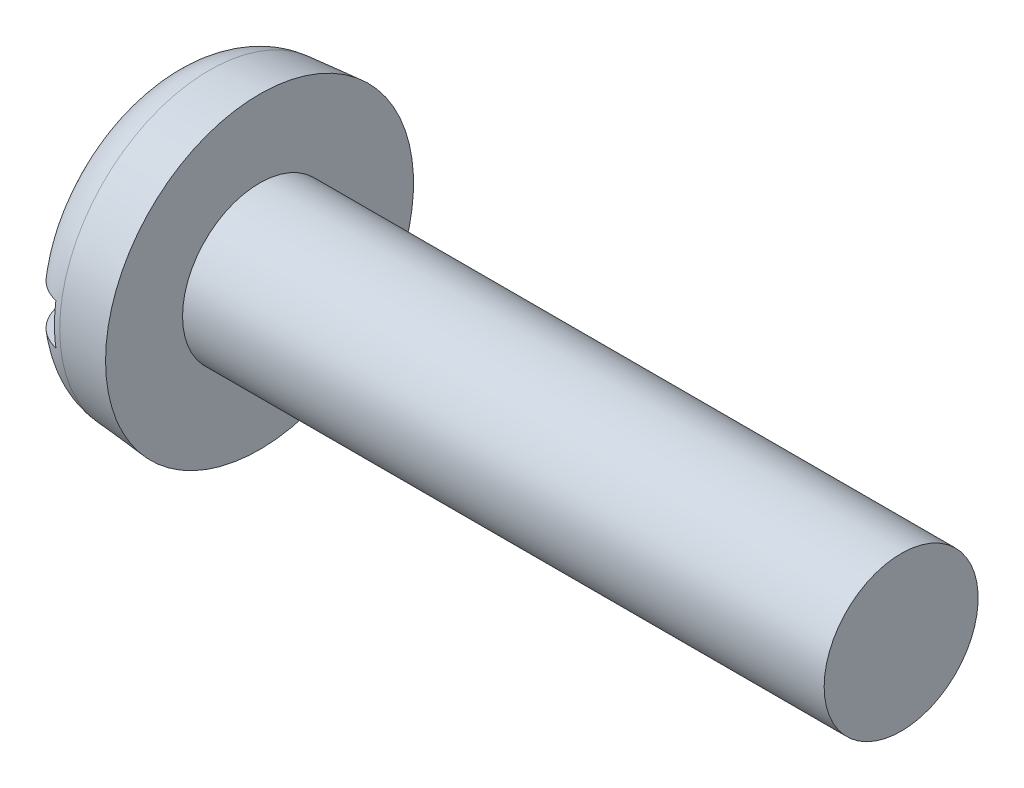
from build123d import *

# Parameters (mm, degrees)
FILLET2_R  = 1.8
SKETCH2_W  = 12
SKETCH2_H  = 1.6
SLOT_DEPTH = 1.4


with BuildPart() as part:
    # BodySke → Base-Revolve (revolve)
    with BuildSketch(Plane.XY, mode=Mode.PRIVATE) as base_revolve_sk:
        Polygon((3.6, 3), (3.6, 6), (0, 5.685040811), (0, 0), (28.6, 0), (28.6, 3), align=None)
    revolve(base_revolve_sk.sketch.rotate(Axis((-25.4, 0, 0), (1, 0, 0)), 90), axis=Axis((-25.4, 0, 0), (1, 0, 0)))

    # Fillet2
    fillet2_edges = [part.edges().sort_by_distance(p)[0] for p in [
        (0, 0, -5.685040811),
    ]]
    fillet(fillet2_edges, radius=FILLET2_R)

    # Sketch2 → Slot (cut)
    with BuildSketch(Plane(origin=(0, 0, 0), x_dir=(0, 0, -1), z_dir=(1, 0, 0))):
        Rectangle(SKETCH2_W, SKETCH2_H)
    extrude(amount=SLOT_DEPTH, mode=Mode.SUBTRACT)


solid = part.part
